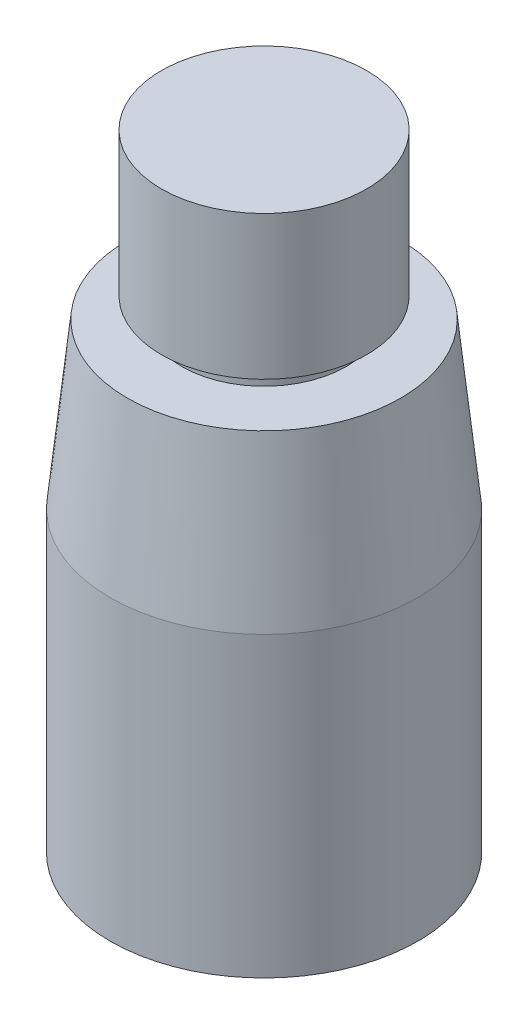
from build123d import *


with BuildPart() as part:
    # Sketch1 → Revolve1 (revolve)
    with BuildSketch(Plane.XY, mode=Mode.PRIVATE) as revolve1_sk:
        Polygon((0, 0), (-7.5, 0), (-7.5, 14.5), (-6.659166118, 22.5), (-4, 22.5), (-4, 23.5), (-5, 23.5), (-5, 30.5), (0, 30.5), align=None)
    revolve(revolve1_sk.sketch.rotate(Axis((0, 85.10264496, 0), (0, -1, 0)), 270), axis=Axis((0, 85.10264496, 0), (0, -1, 0)))


solid = part.part
